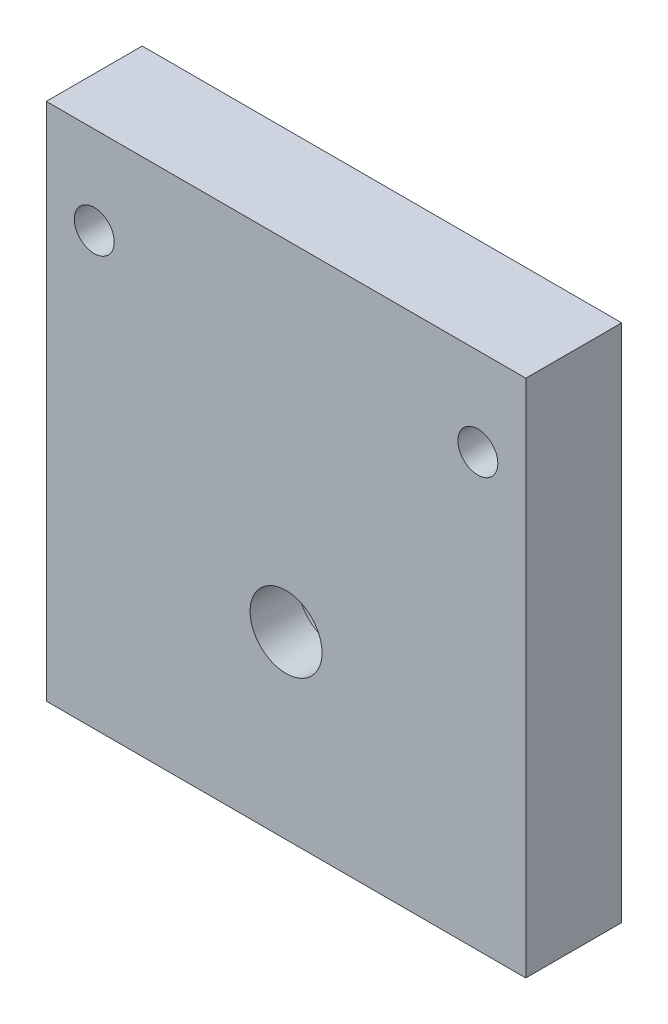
ISO-10303-21;
HEADER;
FILE_DESCRIPTION(('STEP AP214'),'2;1');
FILE_NAME('part.step','',(''),(''),'','','');
FILE_SCHEMA(('AUTOMOTIVE_DESIGN { 1 0 10303 214 1 1 1 1 }'));
ENDSEC;
DATA;
#1=APPLICATION_CONTEXT('core data for automotive mechanical design processes');
#2=APPLICATION_PROTOCOL_DEFINITION('international standard','automotive_design',2000,#1);
#3=PRODUCT_CONTEXT('',#1,'mechanical');
#4=PRODUCT('Part','Part','',(#3));
#5=PRODUCT_RELATED_PRODUCT_CATEGORY('part','',(#4));
#6=PRODUCT_DEFINITION_FORMATION('','',#4);
#7=PRODUCT_DEFINITION_CONTEXT('part definition',#1,'design');
#8=PRODUCT_DEFINITION('design','',#6,#7);
#9=PRODUCT_DEFINITION_SHAPE('','',#8);
#10=(LENGTH_UNIT() NAMED_UNIT(*) SI_UNIT(.MILLI.,.METRE.));
#11=(NAMED_UNIT(*) PLANE_ANGLE_UNIT() SI_UNIT($,.RADIAN.));
#12=(NAMED_UNIT(*) SI_UNIT($,.STERADIAN.) SOLID_ANGLE_UNIT());
#13=UNCERTAINTY_MEASURE_WITH_UNIT(LENGTH_MEASURE(1.E-05),#10,'distance_accuracy_value','');
#14=(GEOMETRIC_REPRESENTATION_CONTEXT(3) GLOBAL_UNCERTAINTY_ASSIGNED_CONTEXT((#13)) GLOBAL_UNIT_ASSIGNED_CONTEXT((#10,
#11,#12)) REPRESENTATION_CONTEXT('',''));
#15=CARTESIAN_POINT('',(0.,0.,0.));
#16=DIRECTION('',(0.,0.,1.));
#17=DIRECTION('',(1.,0.,0.));
#18=AXIS2_PLACEMENT_3D('',#15,#16,#17);
#19=CARTESIAN_POINT('',(0.,0.,0.));
#20=DIRECTION('',(0.,0.,1.));
#21=DIRECTION('',(1.,0.,0.));
#22=AXIS2_PLACEMENT_3D('',#19,#20,#21);
#23=CYLINDRICAL_SURFACE('',#22,7.5);
#24=CARTESIAN_POINT('',(0.,0.,6.));
#25=DIRECTION('',(0.,0.,1.));
#26=DIRECTION('',(1.,0.,0.));
#27=AXIS2_PLACEMENT_3D('',#24,#25,#26);
#28=CIRCLE('',#27,7.5);
#29=CARTESIAN_POINT('',(7.5,0.,6.));
#30=VERTEX_POINT('',#29);
#31=EDGE_CURVE('E19',#30,#30,#28,.T.);
#32=ORIENTED_EDGE('',*,*,#31,.T.);
#33=EDGE_LOOP('',(#32));
#34=FACE_BOUND('',#33,.T.);
#35=CARTESIAN_POINT('',(0.,0.,0.));
#36=DIRECTION('',(0.,0.,1.));
#37=DIRECTION('',(1.,0.,0.));
#38=AXIS2_PLACEMENT_3D('',#35,#36,#37);
#39=CIRCLE('',#38,7.5);
#40=CARTESIAN_POINT('',(7.5,0.,0.));
#41=VERTEX_POINT('',#40);
#42=EDGE_CURVE('E68',#41,#41,#39,.F.);
#43=ORIENTED_EDGE('',*,*,#42,.T.);
#44=EDGE_LOOP('',(#43));
#45=FACE_BOUND('',#44,.T.);
#46=ADVANCED_FACE('F15',(#34,#45),#23,.F.);
#47=CARTESIAN_POINT('',(7.65,7.65,6.));
#48=DIRECTION('',(0.,0.,1.));
#49=DIRECTION('',(-1.,0.,0.));
#50=AXIS2_PLACEMENT_3D('',#47,#48,#49);
#51=PLANE('',#50);
#52=CARTESIAN_POINT('',(0.,0.,6.));
#53=DIRECTION('',(0.,0.,1.));
#54=DIRECTION('',(1.,0.,0.));
#55=AXIS2_PLACEMENT_3D('',#52,#53,#54);
#56=CIRCLE('',#55,4.5);
#57=CARTESIAN_POINT('',(4.5,0.,6.));
#58=VERTEX_POINT('',#57);
#59=EDGE_CURVE('E95',#58,#58,#56,.T.);
#60=ORIENTED_EDGE('',*,*,#59,.T.);
#61=EDGE_LOOP('',(#60));
#62=FACE_BOUND('',#61,.T.);
#63=ORIENTED_EDGE('',*,*,#31,.F.);
#64=EDGE_LOOP('',(#63));
#65=FACE_BOUND('',#64,.T.);
#66=ADVANCED_FACE('F17',(#62,#65),#51,.F.);
#67=CARTESIAN_POINT('',(0.,10.,0.));
#68=DIRECTION('',(0.,0.,1.));
#69=DIRECTION('',(1.,0.,0.));
#70=AXIS2_PLACEMENT_3D('',#67,#68,#69);
#71=PLANE('',#70);
#72=CARTESIAN_POINT('',(-24.,31.5,0.));
#73=DIRECTION('',(0.,0.,1.));
#74=DIRECTION('',(1.,0.,0.));
#75=AXIS2_PLACEMENT_3D('',#72,#73,#74);
#76=CIRCLE('',#75,2.5);
#77=CARTESIAN_POINT('',(-21.5,31.5,0.));
#78=VERTEX_POINT('',#77);
#79=EDGE_CURVE('E88',#78,#78,#76,.T.);
#80=ORIENTED_EDGE('',*,*,#79,.T.);
#81=EDGE_LOOP('',(#80));
#82=FACE_BOUND('',#81,.T.);
#83=CARTESIAN_POINT('',(24.,31.5,0.));
#84=DIRECTION('',(0.,0.,1.));
#85=DIRECTION('',(1.,0.,0.));
#86=AXIS2_PLACEMENT_3D('',#83,#84,#85);
#87=CIRCLE('',#86,2.5);
#88=CARTESIAN_POINT('',(26.5,31.5,0.));
#89=VERTEX_POINT('',#88);
#90=EDGE_CURVE('E92',#89,#89,#87,.T.);
#91=ORIENTED_EDGE('',*,*,#90,.T.);
#92=EDGE_LOOP('',(#91));
#93=FACE_BOUND('',#92,.T.);
#94=ORIENTED_EDGE('',*,*,#42,.F.);
#95=EDGE_LOOP('',(#94));
#96=FACE_BOUND('',#95,.T.);
#97=DIRECTION('',(0.,1.,0.));
#98=VECTOR('',#97,1.);
#99=CARTESIAN_POINT('',(-30.,-22.5,0.));
#100=LINE('',#99,#98);
#101=CARTESIAN_POINT('',(-30.,42.5,0.));
#102=VERTEX_POINT('',#101);
#103=CARTESIAN_POINT('',(-30.,-22.5,0.));
#104=VERTEX_POINT('',#103);
#105=EDGE_CURVE('E59',#102,#104,#100,.F.);
#106=ORIENTED_EDGE('',*,*,#105,.F.);
#107=DIRECTION('',(1.,0.,0.));
#108=VECTOR('',#107,1.);
#109=CARTESIAN_POINT('',(-30.,42.5,0.));
#110=LINE('',#109,#108);
#111=CARTESIAN_POINT('',(30.,42.5,0.));
#112=VERTEX_POINT('',#111);
#113=EDGE_CURVE('E189',#112,#102,#110,.F.);
#114=ORIENTED_EDGE('',*,*,#113,.F.);
#115=DIRECTION('',(0.,1.,0.));
#116=VECTOR('',#115,1.);
#117=CARTESIAN_POINT('',(30.,42.5,0.));
#118=LINE('',#117,#116);
#119=CARTESIAN_POINT('',(30.,-22.5,0.));
#120=VERTEX_POINT('',#119);
#121=EDGE_CURVE('E71',#120,#112,#118,.T.);
#122=ORIENTED_EDGE('',*,*,#121,.F.);
#123=DIRECTION('',(1.,0.,0.));
#124=VECTOR('',#123,1.);
#125=CARTESIAN_POINT('',(30.,-22.5,0.));
#126=LINE('',#125,#124);
#127=EDGE_CURVE('E54',#104,#120,#126,.T.);
#128=ORIENTED_EDGE('',*,*,#127,.F.);
#129=EDGE_LOOP('',(#106,#114,#122,#128));
#130=FACE_BOUND('',#129,.T.);
#131=ADVANCED_FACE('F70',(#82,#93,#96,#130),#71,.F.);
#132=CARTESIAN_POINT('',(-30.,-22.5,0.));
#133=DIRECTION('',(-1.,0.,0.));
#134=DIRECTION('',(0.,0.,1.));
#135=AXIS2_PLACEMENT_3D('',#132,#133,#134);
#136=PLANE('',#135);
#137=ORIENTED_EDGE('',*,*,#105,.T.);
#138=DIRECTION('',(0.,0.,-1.));
#139=VECTOR('',#138,1.);
#140=CARTESIAN_POINT('',(-30.,-22.5,0.));
#141=LINE('',#140,#139);
#142=CARTESIAN_POINT('',(-30.,-22.5,12.));
#143=VERTEX_POINT('',#142);
#144=EDGE_CURVE('E61',#143,#104,#141,.T.);
#145=ORIENTED_EDGE('',*,*,#144,.F.);
#146=DIRECTION('',(0.,1.,0.));
#147=VECTOR('',#146,1.);
#148=CARTESIAN_POINT('',(-30.,10.,12.));
#149=LINE('',#148,#147);
#150=CARTESIAN_POINT('',(-30.,42.5,12.));
#151=VERTEX_POINT('',#150);
#152=EDGE_CURVE('E91',#151,#143,#149,.F.);
#153=ORIENTED_EDGE('',*,*,#152,.F.);
#154=DIRECTION('',(0.,0.,1.));
#155=VECTOR('',#154,1.);
#156=CARTESIAN_POINT('',(-30.,42.5,0.));
#157=LINE('',#156,#155);
#158=EDGE_CURVE('E64',#102,#151,#157,.T.);
#159=ORIENTED_EDGE('',*,*,#158,.F.);
#160=EDGE_LOOP('',(#137,#145,#153,#159));
#161=FACE_BOUND('',#160,.T.);
#162=ADVANCED_FACE('F60',(#161),#136,.T.);
#163=CARTESIAN_POINT('',(30.,-22.5,0.));
#164=DIRECTION('',(0.,-1.,0.));
#165=DIRECTION('',(0.,0.,-1.));
#166=AXIS2_PLACEMENT_3D('',#163,#164,#165);
#167=PLANE('',#166);
#168=ORIENTED_EDGE('',*,*,#127,.T.);
#169=DIRECTION('',(0.,0.,-1.));
#170=VECTOR('',#169,1.);
#171=CARTESIAN_POINT('',(30.,-22.5,0.));
#172=LINE('',#171,#170);
#173=CARTESIAN_POINT('',(30.,-22.5,12.));
#174=VERTEX_POINT('',#173);
#175=EDGE_CURVE('E73',#174,#120,#172,.T.);
#176=ORIENTED_EDGE('',*,*,#175,.F.);
#177=DIRECTION('',(1.,0.,0.));
#178=VECTOR('',#177,1.);
#179=CARTESIAN_POINT('',(0.,-22.5,12.));
#180=LINE('',#179,#178);
#181=EDGE_CURVE('E77',#143,#174,#180,.T.);
#182=ORIENTED_EDGE('',*,*,#181,.F.);
#183=ORIENTED_EDGE('',*,*,#144,.T.);
#184=EDGE_LOOP('',(#168,#176,#182,#183));
#185=FACE_BOUND('',#184,.T.);
#186=ADVANCED_FACE('F75',(#185),#167,.T.);
#187=CARTESIAN_POINT('',(30.,42.5,0.));
#188=DIRECTION('',(1.,0.,0.));
#189=DIRECTION('',(0.,0.,-1.));
#190=AXIS2_PLACEMENT_3D('',#187,#188,#189);
#191=PLANE('',#190);
#192=ORIENTED_EDGE('',*,*,#121,.T.);
#193=DIRECTION('',(0.,0.,1.));
#194=VECTOR('',#193,1.);
#195=CARTESIAN_POINT('',(30.,42.5,0.));
#196=LINE('',#195,#194);
#197=CARTESIAN_POINT('',(30.,42.5,12.));
#198=VERTEX_POINT('',#197);
#199=EDGE_CURVE('E34',#198,#112,#196,.F.);
#200=ORIENTED_EDGE('',*,*,#199,.F.);
#201=DIRECTION('',(0.,1.,0.));
#202=VECTOR('',#201,1.);
#203=CARTESIAN_POINT('',(30.,10.,12.));
#204=LINE('',#203,#202);
#205=EDGE_CURVE('E198',#174,#198,#204,.T.);
#206=ORIENTED_EDGE('',*,*,#205,.F.);
#207=ORIENTED_EDGE('',*,*,#175,.T.);
#208=EDGE_LOOP('',(#192,#200,#206,#207));
#209=FACE_BOUND('',#208,.T.);
#210=ADVANCED_FACE('F136',(#209),#191,.T.);
#211=CARTESIAN_POINT('',(-30.,42.5,0.));
#212=DIRECTION('',(0.,1.,0.));
#213=DIRECTION('',(0.,0.,1.));
#214=AXIS2_PLACEMENT_3D('',#211,#212,#213);
#215=PLANE('',#214);
#216=ORIENTED_EDGE('',*,*,#113,.T.);
#217=ORIENTED_EDGE('',*,*,#158,.T.);
#218=DIRECTION('',(1.,0.,0.));
#219=VECTOR('',#218,1.);
#220=CARTESIAN_POINT('',(0.,42.5,12.));
#221=LINE('',#220,#219);
#222=EDGE_CURVE('E87',#198,#151,#221,.F.);
#223=ORIENTED_EDGE('',*,*,#222,.F.);
#224=ORIENTED_EDGE('',*,*,#199,.T.);
#225=EDGE_LOOP('',(#216,#217,#223,#224));
#226=FACE_BOUND('',#225,.T.);
#227=ADVANCED_FACE('F132',(#226),#215,.T.);
#228=CARTESIAN_POINT('',(0.,0.,0.));
#229=DIRECTION('',(0.,0.,1.));
#230=DIRECTION('',(1.,0.,0.));
#231=AXIS2_PLACEMENT_3D('',#228,#229,#230);
#232=CYLINDRICAL_SURFACE('',#231,4.5);
#233=CARTESIAN_POINT('',(0.,0.,12.));
#234=DIRECTION('',(0.,0.,1.));
#235=DIRECTION('',(1.,0.,0.));
#236=AXIS2_PLACEMENT_3D('',#233,#234,#235);
#237=CIRCLE('',#236,4.5);
#238=CARTESIAN_POINT('',(4.5,0.,12.));
#239=VERTEX_POINT('',#238);
#240=EDGE_CURVE('E84',#239,#239,#237,.F.);
#241=ORIENTED_EDGE('',*,*,#240,.F.);
#242=EDGE_LOOP('',(#241));
#243=FACE_BOUND('',#242,.T.);
#244=ORIENTED_EDGE('',*,*,#59,.F.);
#245=EDGE_LOOP('',(#244));
#246=FACE_BOUND('',#245,.T.);
#247=ADVANCED_FACE('F128',(#243,#246),#232,.F.);
#248=CARTESIAN_POINT('',(24.,31.5,0.));
#249=DIRECTION('',(0.,0.,1.));
#250=DIRECTION('',(1.,0.,0.));
#251=AXIS2_PLACEMENT_3D('',#248,#249,#250);
#252=CYLINDRICAL_SURFACE('',#251,2.5);
#253=ORIENTED_EDGE('',*,*,#90,.F.);
#254=EDGE_LOOP('',(#253));
#255=FACE_BOUND('',#254,.T.);
#256=CARTESIAN_POINT('',(24.,31.5,12.));
#257=DIRECTION('',(0.,0.,1.));
#258=DIRECTION('',(1.,0.,0.));
#259=AXIS2_PLACEMENT_3D('',#256,#257,#258);
#260=CIRCLE('',#259,2.5);
#261=CARTESIAN_POINT('',(26.5,31.5,12.));
#262=VERTEX_POINT('',#261);
#263=EDGE_CURVE('E25',#262,#262,#260,.F.);
#264=ORIENTED_EDGE('',*,*,#263,.F.);
#265=EDGE_LOOP('',(#264));
#266=FACE_BOUND('',#265,.T.);
#267=ADVANCED_FACE('F121',(#255,#266),#252,.F.);
#268=CARTESIAN_POINT('',(-24.,31.5,0.));
#269=DIRECTION('',(0.,0.,1.));
#270=DIRECTION('',(1.,0.,0.));
#271=AXIS2_PLACEMENT_3D('',#268,#269,#270);
#272=CYLINDRICAL_SURFACE('',#271,2.5);
#273=ORIENTED_EDGE('',*,*,#79,.F.);
#274=EDGE_LOOP('',(#273));
#275=FACE_BOUND('',#274,.T.);
#276=CARTESIAN_POINT('',(-24.,31.5,12.));
#277=DIRECTION('',(0.,0.,1.));
#278=DIRECTION('',(1.,0.,0.));
#279=AXIS2_PLACEMENT_3D('',#276,#277,#278);
#280=CIRCLE('',#279,2.5);
#281=CARTESIAN_POINT('',(-21.5,31.5,12.));
#282=VERTEX_POINT('',#281);
#283=EDGE_CURVE('E10',#282,#282,#280,.F.);
#284=ORIENTED_EDGE('',*,*,#283,.F.);
#285=EDGE_LOOP('',(#284));
#286=FACE_BOUND('',#285,.T.);
#287=ADVANCED_FACE('F115',(#275,#286),#272,.F.);
#288=CARTESIAN_POINT('',(0.,10.,12.));
#289=DIRECTION('',(0.,0.,1.));
#290=DIRECTION('',(1.,0.,0.));
#291=AXIS2_PLACEMENT_3D('',#288,#289,#290);
#292=PLANE('',#291);
#293=ORIENTED_EDGE('',*,*,#283,.T.);
#294=EDGE_LOOP('',(#293));
#295=FACE_BOUND('',#294,.T.);
#296=ORIENTED_EDGE('',*,*,#263,.T.);
#297=EDGE_LOOP('',(#296));
#298=FACE_BOUND('',#297,.T.);
#299=ORIENTED_EDGE('',*,*,#240,.T.);
#300=EDGE_LOOP('',(#299));
#301=FACE_BOUND('',#300,.T.);
#302=ORIENTED_EDGE('',*,*,#205,.T.);
#303=ORIENTED_EDGE('',*,*,#222,.T.);
#304=ORIENTED_EDGE('',*,*,#152,.T.);
#305=ORIENTED_EDGE('',*,*,#181,.T.);
#306=EDGE_LOOP('',(#302,#303,#304,#305));
#307=FACE_BOUND('',#306,.T.);
#308=ADVANCED_FACE('F113',(#295,#298,#301,#307),#292,.T.);
#309=CLOSED_SHELL('',(#46,#66,#131,#162,#186,#210,#227,#247,#267,#287,#308));
#310=MANIFOLD_SOLID_BREP('B1',#309);
#311=ADVANCED_BREP_SHAPE_REPRESENTATION('',(#18,#310),#14);
#312=SHAPE_DEFINITION_REPRESENTATION(#9,#311);
ENDSEC;
END-ISO-10303-21;
